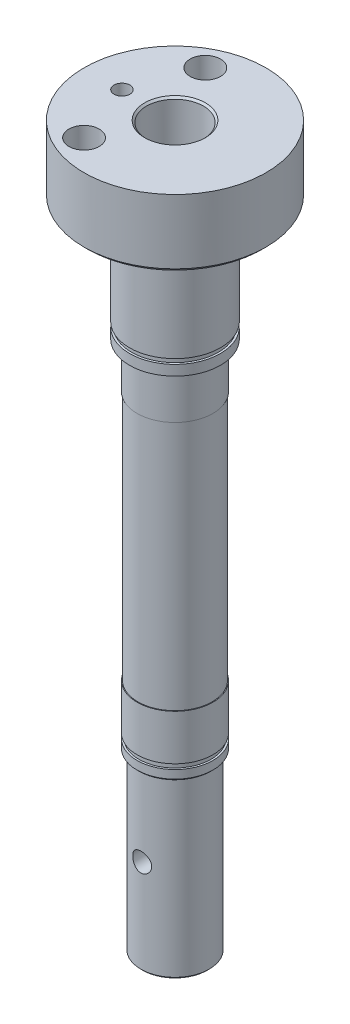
ISO-10303-21;
HEADER;
FILE_DESCRIPTION(('STEP AP214'),'2;1');
FILE_NAME('part.step','',(''),(''),'','','');
FILE_SCHEMA(('AUTOMOTIVE_DESIGN { 1 0 10303 214 1 1 1 1 }'));
ENDSEC;
DATA;
#1=APPLICATION_CONTEXT('core data for automotive mechanical design processes');
#2=APPLICATION_PROTOCOL_DEFINITION('international standard','automotive_design',2000,#1);
#3=PRODUCT_CONTEXT('',#1,'mechanical');
#4=PRODUCT('Part','Part','',(#3));
#5=PRODUCT_RELATED_PRODUCT_CATEGORY('part','',(#4));
#6=PRODUCT_DEFINITION_FORMATION('','',#4);
#7=PRODUCT_DEFINITION_CONTEXT('part definition',#1,'design');
#8=PRODUCT_DEFINITION('design','',#6,#7);
#9=PRODUCT_DEFINITION_SHAPE('','',#8);
#10=(LENGTH_UNIT() NAMED_UNIT(*) SI_UNIT(.MILLI.,.METRE.));
#11=(NAMED_UNIT(*) PLANE_ANGLE_UNIT() SI_UNIT($,.RADIAN.));
#12=(NAMED_UNIT(*) SI_UNIT($,.STERADIAN.) SOLID_ANGLE_UNIT());
#13=UNCERTAINTY_MEASURE_WITH_UNIT(LENGTH_MEASURE(1.E-05),#10,'distance_accuracy_value','');
#14=(GEOMETRIC_REPRESENTATION_CONTEXT(3) GLOBAL_UNCERTAINTY_ASSIGNED_CONTEXT((#13)) GLOBAL_UNIT_ASSIGNED_CONTEXT((#10,
#11,#12)) REPRESENTATION_CONTEXT('',''));
#15=CARTESIAN_POINT('',(0.,0.,0.));
#16=DIRECTION('',(0.,0.,1.));
#17=DIRECTION('',(1.,0.,0.));
#18=AXIS2_PLACEMENT_3D('',#15,#16,#17);
#19=CARTESIAN_POINT('',(0.,0.,0.));
#20=DIRECTION('',(0.,-1.,0.));
#21=DIRECTION('',(0.,0.,-1.));
#22=AXIS2_PLACEMENT_3D('',#19,#20,#21);
#23=CYLINDRICAL_SURFACE('',#22,9.99999999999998);
#24=CARTESIAN_POINT('',(0.,50.,0.));
#25=DIRECTION('',(0.,-1.,0.));
#26=DIRECTION('',(0.,0.,-1.));
#27=AXIS2_PLACEMENT_3D('',#24,#25,#26);
#28=CIRCLE('',#27,10.);
#29=CARTESIAN_POINT('',(0.,50.,-10.));
#30=VERTEX_POINT('',#29);
#31=EDGE_CURVE('E131',#30,#30,#28,.T.);
#32=ORIENTED_EDGE('',*,*,#31,.F.);
#33=EDGE_LOOP('',(#32));
#34=FACE_BOUND('',#33,.T.);
#35=CARTESIAN_POINT('',(0.,62.,0.));
#36=DIRECTION('',(0.,-1.,0.));
#37=DIRECTION('',(0.,0.,-1.));
#38=AXIS2_PLACEMENT_3D('',#35,#36,#37);
#39=CIRCLE('',#38,9.99999999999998);
#40=CARTESIAN_POINT('',(0.,62.,-9.99999999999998));
#41=VERTEX_POINT('',#40);
#42=EDGE_CURVE('E149',#41,#41,#39,.T.);
#43=ORIENTED_EDGE('',*,*,#42,.T.);
#44=EDGE_LOOP('',(#43));
#45=FACE_BOUND('',#44,.T.);
#46=ADVANCED_FACE('F38',(#34,#45),#23,.T.);
#47=CARTESIAN_POINT('',(0.,0.,0.));
#48=DIRECTION('',(0.,-1.,0.));
#49=DIRECTION('',(0.,0.,-1.));
#50=AXIS2_PLACEMENT_3D('',#47,#48,#49);
#51=CYLINDRICAL_SURFACE('',#50,12.);
#52=CARTESIAN_POINT('',(0.,140.,0.));
#53=DIRECTION('',(0.,-1.,0.));
#54=DIRECTION('',(0.,0.,-1.));
#55=AXIS2_PLACEMENT_3D('',#52,#53,#54);
#56=CIRCLE('',#55,12.);
#57=CARTESIAN_POINT('',(-11.9853571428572,140.,-0.592633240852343));
#58=VERTEX_POINT('',#57);
#59=CARTESIAN_POINT('',(-11.9853571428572,140.,0.592633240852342));
#60=VERTEX_POINT('',#59);
#61=EDGE_CURVE('E164',#58,#60,#56,.T.);
#62=ORIENTED_EDGE('',*,*,#61,.F.);
#63=DIRECTION('',(0.,1.,0.));
#64=VECTOR('',#63,1.);
#65=CARTESIAN_POINT('',(-11.9853571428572,141.35,-0.592633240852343));
#66=LINE('',#65,#64);
#67=CARTESIAN_POINT('',(-11.9853571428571,142.7,-0.592633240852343));
#68=VERTEX_POINT('',#67);
#69=EDGE_CURVE('E102',#58,#68,#66,.T.);
#70=ORIENTED_EDGE('',*,*,#69,.T.);
#71=CARTESIAN_POINT('',(0.,142.7,0.));
#72=DIRECTION('',(0.,-1.,0.));
#73=DIRECTION('',(0.,0.,-1.));
#74=AXIS2_PLACEMENT_3D('',#71,#72,#73);
#75=CIRCLE('',#74,12.);
#76=CARTESIAN_POINT('',(-11.9853571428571,142.7,0.592633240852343));
#77=VERTEX_POINT('',#76);
#78=EDGE_CURVE('E143',#68,#77,#75,.T.);
#79=ORIENTED_EDGE('',*,*,#78,.T.);
#80=DIRECTION('',(0.,1.,0.));
#81=VECTOR('',#80,1.);
#82=CARTESIAN_POINT('',(-11.9853571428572,141.35,0.592633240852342));
#83=LINE('',#82,#81);
#84=EDGE_CURVE('E53',#77,#60,#83,.F.);
#85=ORIENTED_EDGE('',*,*,#84,.T.);
#86=EDGE_LOOP('',(#62,#70,#79,#85));
#87=FACE_BOUND('',#86,.T.);
#88=ADVANCED_FACE('F238',(#87),#51,.T.);
#89=CARTESIAN_POINT('',(12.,140.,0.));
#90=DIRECTION('',(0.,1.,0.));
#91=DIRECTION('',(0.,0.,1.));
#92=AXIS2_PLACEMENT_3D('',#89,#90,#91);
#93=PLANE('',#92);
#94=CARTESIAN_POINT('',(0.,140.,0.));
#95=DIRECTION('',(0.,-1.,0.));
#96=DIRECTION('',(0.,0.,-1.));
#97=AXIS2_PLACEMENT_3D('',#94,#95,#96);
#98=CIRCLE('',#97,9.99999999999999);
#99=CARTESIAN_POINT('',(0.,140.,-9.99999999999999));
#100=VERTEX_POINT('',#99);
#101=EDGE_CURVE('E161',#100,#100,#98,.T.);
#102=ORIENTED_EDGE('',*,*,#101,.F.);
#103=EDGE_LOOP('',(#102));
#104=FACE_BOUND('',#103,.T.);
#105=ORIENTED_EDGE('',*,*,#61,.T.);
#106=CARTESIAN_POINT('',(-14.,140.,0.));
#107=DIRECTION('',(0.,1.,0.));
#108=DIRECTION('',(0.,0.,1.));
#109=AXIS2_PLACEMENT_3D('',#106,#107,#108);
#110=CIRCLE('',#109,2.09999999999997);
#111=EDGE_CURVE('E105',#60,#58,#110,.T.);
#112=ORIENTED_EDGE('',*,*,#111,.T.);
#113=EDGE_LOOP('',(#105,#112));
#114=FACE_BOUND('',#113,.T.);
#115=ADVANCED_FACE('F244',(#104,#114),#93,.F.);
#116=CARTESIAN_POINT('',(0.,0.,0.));
#117=DIRECTION('',(0.,-1.,0.));
#118=DIRECTION('',(0.,0.,-1.));
#119=AXIS2_PLACEMENT_3D('',#116,#117,#118);
#120=CYLINDRICAL_SURFACE('',#119,9.99999999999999);
#121=CARTESIAN_POINT('',(0.,128.,0.));
#122=DIRECTION('',(0.,-1.,0.));
#123=DIRECTION('',(0.,0.,-1.));
#124=AXIS2_PLACEMENT_3D('',#121,#122,#123);
#125=CIRCLE('',#124,9.99999999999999);
#126=CARTESIAN_POINT('',(0.,128.,-9.99999999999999));
#127=VERTEX_POINT('',#126);
#128=EDGE_CURVE('E158',#127,#127,#125,.T.);
#129=ORIENTED_EDGE('',*,*,#128,.F.);
#130=EDGE_LOOP('',(#129));
#131=FACE_BOUND('',#130,.T.);
#132=ORIENTED_EDGE('',*,*,#101,.T.);
#133=EDGE_LOOP('',(#132));
#134=FACE_BOUND('',#133,.T.);
#135=ADVANCED_FACE('F509',(#131,#134),#120,.T.);
#136=CARTESIAN_POINT('',(9.99999999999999,128.,0.));
#137=DIRECTION('',(0.,1.,0.));
#138=DIRECTION('',(0.,0.,1.));
#139=AXIS2_PLACEMENT_3D('',#136,#137,#138);
#140=PLANE('',#139);
#141=CARTESIAN_POINT('',(0.,128.,0.));
#142=DIRECTION('',(0.,-1.,0.));
#143=DIRECTION('',(0.,0.,-1.));
#144=AXIS2_PLACEMENT_3D('',#141,#142,#143);
#145=CIRCLE('',#144,9.79999999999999);
#146=CARTESIAN_POINT('',(0.,128.,-9.79999999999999));
#147=VERTEX_POINT('',#146);
#148=EDGE_CURVE('E155',#147,#147,#145,.T.);
#149=ORIENTED_EDGE('',*,*,#148,.F.);
#150=EDGE_LOOP('',(#149));
#151=FACE_BOUND('',#150,.T.);
#152=ORIENTED_EDGE('',*,*,#128,.T.);
#153=EDGE_LOOP('',(#152));
#154=FACE_BOUND('',#153,.T.);
#155=ADVANCED_FACE('F499',(#151,#154),#140,.F.);
#156=CARTESIAN_POINT('',(0.,0.,0.));
#157=DIRECTION('',(0.,-1.,0.));
#158=DIRECTION('',(0.,0.,-1.));
#159=AXIS2_PLACEMENT_3D('',#156,#157,#158);
#160=CYLINDRICAL_SURFACE('',#159,9.79999999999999);
#161=CARTESIAN_POINT('',(0.,62.,0.));
#162=DIRECTION('',(0.,-1.,0.));
#163=DIRECTION('',(0.,0.,-1.));
#164=AXIS2_PLACEMENT_3D('',#161,#162,#163);
#165=CIRCLE('',#164,9.79999999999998);
#166=CARTESIAN_POINT('',(0.,62.,-9.79999999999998));
#167=VERTEX_POINT('',#166);
#168=EDGE_CURVE('E152',#167,#167,#165,.T.);
#169=ORIENTED_EDGE('',*,*,#168,.F.);
#170=EDGE_LOOP('',(#169));
#171=FACE_BOUND('',#170,.T.);
#172=ORIENTED_EDGE('',*,*,#148,.T.);
#173=EDGE_LOOP('',(#172));
#174=FACE_BOUND('',#173,.T.);
#175=ADVANCED_FACE('F491',(#171,#174),#160,.T.);
#176=CARTESIAN_POINT('',(9.79999999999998,62.,0.));
#177=DIRECTION('',(0.,-1.,0.));
#178=DIRECTION('',(0.,0.,-1.));
#179=AXIS2_PLACEMENT_3D('',#176,#177,#178);
#180=PLANE('',#179);
#181=ORIENTED_EDGE('',*,*,#42,.F.);
#182=EDGE_LOOP('',(#181));
#183=FACE_BOUND('',#182,.T.);
#184=ORIENTED_EDGE('',*,*,#168,.T.);
#185=EDGE_LOOP('',(#184));
#186=FACE_BOUND('',#185,.T.);
#187=ADVANCED_FACE('F227',(#183,#186),#180,.F.);
#188=CARTESIAN_POINT('',(12.,142.7,0.));
#189=DIRECTION('',(0.,1.,0.));
#190=DIRECTION('',(0.,0.,1.));
#191=AXIS2_PLACEMENT_3D('',#188,#189,#190);
#192=PLANE('',#191);
#193=CARTESIAN_POINT('',(-14.,142.7,0.));
#194=DIRECTION('',(0.,1.,0.));
#195=DIRECTION('',(0.,0.,1.));
#196=AXIS2_PLACEMENT_3D('',#193,#194,#195);
#197=CIRCLE('',#196,2.09999999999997);
#198=EDGE_CURVE('E99',#77,#68,#197,.T.);
#199=ORIENTED_EDGE('',*,*,#198,.F.);
#200=ORIENTED_EDGE('',*,*,#78,.F.);
#201=EDGE_LOOP('',(#199,#200));
#202=FACE_BOUND('',#201,.T.);
#203=CARTESIAN_POINT('',(0.,142.7,0.));
#204=DIRECTION('',(0.,-1.,0.));
#205=DIRECTION('',(0.,0.,-1.));
#206=AXIS2_PLACEMENT_3D('',#203,#204,#205);
#207=CIRCLE('',#206,11.45);
#208=CARTESIAN_POINT('',(0.,142.7,-11.45));
#209=VERTEX_POINT('',#208);
#210=EDGE_CURVE('E140',#209,#209,#207,.T.);
#211=ORIENTED_EDGE('',*,*,#210,.T.);
#212=EDGE_LOOP('',(#211));
#213=FACE_BOUND('',#212,.T.);
#214=ADVANCED_FACE('F224',(#202,#213),#192,.T.);
#215=CARTESIAN_POINT('',(0.,0.,0.));
#216=DIRECTION('',(0.,-1.,0.));
#217=DIRECTION('',(0.,0.,-1.));
#218=AXIS2_PLACEMENT_3D('',#215,#216,#217);
#219=CYLINDRICAL_SURFACE('',#218,11.45);
#220=ORIENTED_EDGE('',*,*,#210,.F.);
#221=EDGE_LOOP('',(#220));
#222=FACE_BOUND('',#221,.T.);
#223=CARTESIAN_POINT('',(0.,144.,0.));
#224=DIRECTION('',(0.,-1.,0.));
#225=DIRECTION('',(0.,0.,-1.));
#226=AXIS2_PLACEMENT_3D('',#223,#224,#225);
#227=CIRCLE('',#226,11.45);
#228=CARTESIAN_POINT('',(0.,144.,-11.45));
#229=VERTEX_POINT('',#228);
#230=EDGE_CURVE('E137',#229,#229,#227,.T.);
#231=ORIENTED_EDGE('',*,*,#230,.T.);
#232=EDGE_LOOP('',(#231));
#233=FACE_BOUND('',#232,.T.);
#234=ADVANCED_FACE('F220',(#222,#233),#219,.T.);
#235=CARTESIAN_POINT('',(11.45,144.,0.));
#236=DIRECTION('',(0.,-1.,0.));
#237=DIRECTION('',(0.,0.,-1.));
#238=AXIS2_PLACEMENT_3D('',#235,#236,#237);
#239=PLANE('',#238);
#240=CARTESIAN_POINT('',(-14.,144.,0.));
#241=DIRECTION('',(0.,-1.,0.));
#242=DIRECTION('',(0.,0.,-1.));
#243=AXIS2_PLACEMENT_3D('',#240,#241,#242);
#244=CIRCLE('',#243,2.09999999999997);
#245=CARTESIAN_POINT('',(-11.9853571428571,144.,-0.592633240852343));
#246=VERTEX_POINT('',#245);
#247=CARTESIAN_POINT('',(-11.9853571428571,144.,0.592633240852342));
#248=VERTEX_POINT('',#247);
#249=EDGE_CURVE('E61',#246,#248,#244,.T.);
#250=ORIENTED_EDGE('',*,*,#249,.F.);
#251=CARTESIAN_POINT('',(0.,144.,0.));
#252=DIRECTION('',(0.,-1.,0.));
#253=DIRECTION('',(0.,0.,-1.));
#254=AXIS2_PLACEMENT_3D('',#251,#252,#253);
#255=CIRCLE('',#254,12.);
#256=EDGE_CURVE('E134',#246,#248,#255,.T.);
#257=ORIENTED_EDGE('',*,*,#256,.T.);
#258=EDGE_LOOP('',(#250,#257));
#259=FACE_BOUND('',#258,.T.);
#260=ORIENTED_EDGE('',*,*,#230,.F.);
#261=EDGE_LOOP('',(#260));
#262=FACE_BOUND('',#261,.T.);
#263=ADVANCED_FACE('F217',(#259,#262),#239,.T.);
#264=CARTESIAN_POINT('',(0.,190.,0.));
#265=DIRECTION('',(0.,-1.,0.));
#266=DIRECTION('',(0.,0.,-1.));
#267=AXIS2_PLACEMENT_3D('',#264,#265,#266);
#268=PLANE('',#267);
#269=CARTESIAN_POINT('',(0.,190.,0.));
#270=DIRECTION('',(0.,-1.,0.));
#271=DIRECTION('',(0.,0.,-1.));
#272=AXIS2_PLACEMENT_3D('',#269,#270,#271);
#273=CIRCLE('',#272,8.);
#274=CARTESIAN_POINT('',(0.,190.,-8.));
#275=VERTEX_POINT('',#274);
#276=EDGE_CURVE('E11',#275,#275,#273,.T.);
#277=ORIENTED_EDGE('',*,*,#276,.T.);
#278=EDGE_LOOP('',(#277));
#279=FACE_BOUND('',#278,.T.);
#280=CARTESIAN_POINT('',(-14.,190.,0.));
#281=DIRECTION('',(0.,1.,0.));
#282=DIRECTION('',(0.,0.,1.));
#283=AXIS2_PLACEMENT_3D('',#280,#281,#282);
#284=CIRCLE('',#283,2.09999999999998);
#285=CARTESIAN_POINT('',(-14.,190.,2.09999999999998));
#286=VERTEX_POINT('',#285);
#287=EDGE_CURVE('E90',#286,#286,#284,.T.);
#288=ORIENTED_EDGE('',*,*,#287,.F.);
#289=EDGE_LOOP('',(#288));
#290=FACE_BOUND('',#289,.T.);
#291=CARTESIAN_POINT('',(-8.,190.,16.));
#292=DIRECTION('',(0.,1.,0.));
#293=DIRECTION('',(0.,0.,1.));
#294=AXIS2_PLACEMENT_3D('',#291,#292,#293);
#295=CIRCLE('',#294,4.);
#296=CARTESIAN_POINT('',(-8.,190.,20.));
#297=VERTEX_POINT('',#296);
#298=EDGE_CURVE('E108',#297,#297,#295,.T.);
#299=ORIENTED_EDGE('',*,*,#298,.F.);
#300=EDGE_LOOP('',(#299));
#301=FACE_BOUND('',#300,.T.);
#302=CARTESIAN_POINT('',(-8.,190.,-16.));
#303=DIRECTION('',(0.,1.,0.));
#304=DIRECTION('',(0.,0.,1.));
#305=AXIS2_PLACEMENT_3D('',#302,#303,#304);
#306=CIRCLE('',#305,4.);
#307=CARTESIAN_POINT('',(-8.,190.,-12.));
#308=VERTEX_POINT('',#307);
#309=EDGE_CURVE('E115',#308,#308,#306,.T.);
#310=ORIENTED_EDGE('',*,*,#309,.F.);
#311=EDGE_LOOP('',(#310));
#312=FACE_BOUND('',#311,.T.);
#313=CARTESIAN_POINT('',(0.,190.,0.));
#314=DIRECTION('',(0.,-1.,0.));
#315=DIRECTION('',(0.,0.,-1.));
#316=AXIS2_PLACEMENT_3D('',#313,#314,#315);
#317=CIRCLE('',#316,24.);
#318=CARTESIAN_POINT('',(0.,190.,-24.));
#319=VERTEX_POINT('',#318);
#320=EDGE_CURVE('E170',#319,#319,#317,.T.);
#321=ORIENTED_EDGE('',*,*,#320,.F.);
#322=EDGE_LOOP('',(#321));
#323=FACE_BOUND('',#322,.T.);
#324=ADVANCED_FACE('F40',(#279,#290,#301,#312,#323),#268,.F.);
#325=CARTESIAN_POINT('',(0.,0.,0.));
#326=DIRECTION('',(0.,-1.,0.));
#327=DIRECTION('',(0.,0.,-1.));
#328=AXIS2_PLACEMENT_3D('',#325,#326,#327);
#329=CYLINDRICAL_SURFACE('',#328,24.);
#330=CARTESIAN_POINT('',(0.,173.,0.));
#331=DIRECTION('',(0.,1.,0.));
#332=DIRECTION('',(0.,0.,1.));
#333=AXIS2_PLACEMENT_3D('',#330,#331,#332);
#334=CIRCLE('',#333,24.);
#335=CARTESIAN_POINT('',(0.,173.,24.));
#336=VERTEX_POINT('',#335);
#337=EDGE_CURVE('E269',#336,#336,#334,.T.);
#338=ORIENTED_EDGE('',*,*,#337,.T.);
#339=EDGE_LOOP('',(#338));
#340=FACE_BOUND('',#339,.T.);
#341=ORIENTED_EDGE('',*,*,#320,.T.);
#342=EDGE_LOOP('',(#341));
#343=FACE_BOUND('',#342,.T.);
#344=ADVANCED_FACE('F384',(#340,#343),#329,.T.);
#345=CARTESIAN_POINT('',(24.,172.,0.));
#346=DIRECTION('',(0.,1.,0.));
#347=DIRECTION('',(0.,0.,1.));
#348=AXIS2_PLACEMENT_3D('',#345,#346,#347);
#349=PLANE('',#348);
#350=CARTESIAN_POINT('',(-8.,172.,16.));
#351=DIRECTION('',(0.,1.,0.));
#352=DIRECTION('',(0.,0.,1.));
#353=AXIS2_PLACEMENT_3D('',#350,#351,#352);
#354=CIRCLE('',#353,4.);
#355=CARTESIAN_POINT('',(-8.,172.,20.));
#356=VERTEX_POINT('',#355);
#357=EDGE_CURVE('E111',#356,#356,#354,.F.);
#358=ORIENTED_EDGE('',*,*,#357,.F.);
#359=EDGE_LOOP('',(#358));
#360=FACE_BOUND('',#359,.T.);
#361=CARTESIAN_POINT('',(0.,172.,0.));
#362=DIRECTION('',(0.,1.,0.));
#363=DIRECTION('',(0.,0.,1.));
#364=AXIS2_PLACEMENT_3D('',#361,#362,#363);
#365=CIRCLE('',#364,23.);
#366=CARTESIAN_POINT('',(0.,172.,23.));
#367=VERTEX_POINT('',#366);
#368=EDGE_CURVE('E265',#367,#367,#365,.F.);
#369=ORIENTED_EDGE('',*,*,#368,.T.);
#370=EDGE_LOOP('',(#369));
#371=FACE_BOUND('',#370,.T.);
#372=CARTESIAN_POINT('',(-8.,172.,-16.));
#373=DIRECTION('',(0.,1.,0.));
#374=DIRECTION('',(0.,0.,1.));
#375=AXIS2_PLACEMENT_3D('',#372,#373,#374);
#376=CIRCLE('',#375,4.);
#377=CARTESIAN_POINT('',(-8.,172.,-12.));
#378=VERTEX_POINT('',#377);
#379=EDGE_CURVE('E118',#378,#378,#376,.F.);
#380=ORIENTED_EDGE('',*,*,#379,.F.);
#381=EDGE_LOOP('',(#380));
#382=FACE_BOUND('',#381,.T.);
#383=CARTESIAN_POINT('',(0.,172.,0.));
#384=DIRECTION('',(0.,-1.,0.));
#385=DIRECTION('',(0.,0.,-1.));
#386=AXIS2_PLACEMENT_3D('',#383,#384,#385);
#387=CIRCLE('',#386,12.);
#388=CARTESIAN_POINT('',(-11.9853571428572,172.,-0.592633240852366));
#389=VERTEX_POINT('',#388);
#390=CARTESIAN_POINT('',(-11.9853571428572,172.,0.592633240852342));
#391=VERTEX_POINT('',#390);
#392=EDGE_CURVE('E167',#389,#391,#387,.T.);
#393=ORIENTED_EDGE('',*,*,#392,.F.);
#394=CARTESIAN_POINT('',(-14.,172.,0.));
#395=DIRECTION('',(0.,1.,0.));
#396=DIRECTION('',(0.,0.,1.));
#397=AXIS2_PLACEMENT_3D('',#394,#395,#396);
#398=CIRCLE('',#397,2.09999999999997);
#399=EDGE_CURVE('E93',#389,#391,#398,.T.);
#400=ORIENTED_EDGE('',*,*,#399,.T.);
#401=EDGE_LOOP('',(#393,#400));
#402=FACE_BOUND('',#401,.T.);
#403=ADVANCED_FACE('F466',(#360,#371,#382,#402),#349,.F.);
#404=ORIENTED_EDGE('',*,*,#256,.F.);
#405=DIRECTION('',(0.,1.,0.));
#406=VECTOR('',#405,1.);
#407=CARTESIAN_POINT('',(-11.9853571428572,95.,-0.592633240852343));
#408=LINE('',#407,#406);
#409=EDGE_CURVE('E280',#246,#389,#408,.T.);
#410=ORIENTED_EDGE('',*,*,#409,.T.);
#411=ORIENTED_EDGE('',*,*,#392,.T.);
#412=DIRECTION('',(0.,1.,0.));
#413=VECTOR('',#412,1.);
#414=CARTESIAN_POINT('',(-11.9853571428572,95.,0.592633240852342));
#415=LINE('',#414,#413);
#416=EDGE_CURVE('E278',#391,#248,#415,.F.);
#417=ORIENTED_EDGE('',*,*,#416,.T.);
#418=EDGE_LOOP('',(#404,#410,#411,#417));
#419=FACE_BOUND('',#418,.T.);
#420=ADVANCED_FACE('F215',(#419),#51,.T.);
#421=CARTESIAN_POINT('',(10.,50.,0.));
#422=DIRECTION('',(0.,1.,0.));
#423=DIRECTION('',(0.,0.,1.));
#424=AXIS2_PLACEMENT_3D('',#421,#422,#423);
#425=PLANE('',#424);
#426=CARTESIAN_POINT('',(0.,50.,0.));
#427=DIRECTION('',(0.,-1.,0.));
#428=DIRECTION('',(0.,0.,-1.));
#429=AXIS2_PLACEMENT_3D('',#426,#427,#428);
#430=CIRCLE('',#429,9.5);
#431=CARTESIAN_POINT('',(0.,50.,-9.5));
#432=VERTEX_POINT('',#431);
#433=EDGE_CURVE('E128',#432,#432,#430,.T.);
#434=ORIENTED_EDGE('',*,*,#433,.F.);
#435=EDGE_LOOP('',(#434));
#436=FACE_BOUND('',#435,.T.);
#437=ORIENTED_EDGE('',*,*,#31,.T.);
#438=EDGE_LOOP('',(#437));
#439=FACE_BOUND('',#438,.T.);
#440=ADVANCED_FACE('F211',(#436,#439),#425,.F.);
#441=CARTESIAN_POINT('',(0.,0.,0.));
#442=DIRECTION('',(0.,-1.,0.));
#443=DIRECTION('',(0.,0.,-1.));
#444=AXIS2_PLACEMENT_3D('',#441,#442,#443);
#445=CYLINDRICAL_SURFACE('',#444,9.5);
#446=ORIENTED_EDGE('',*,*,#433,.T.);
#447=EDGE_LOOP('',(#446));
#448=FACE_BOUND('',#447,.T.);
#449=CARTESIAN_POINT('',(0.,48.7,0.));
#450=DIRECTION('',(0.,-1.,0.));
#451=DIRECTION('',(0.,0.,-1.));
#452=AXIS2_PLACEMENT_3D('',#449,#450,#451);
#453=CIRCLE('',#452,9.5);
#454=CARTESIAN_POINT('',(0.,48.7,-9.5));
#455=VERTEX_POINT('',#454);
#456=EDGE_CURVE('E125',#455,#455,#453,.T.);
#457=ORIENTED_EDGE('',*,*,#456,.F.);
#458=EDGE_LOOP('',(#457));
#459=FACE_BOUND('',#458,.T.);
#460=ADVANCED_FACE('F207',(#448,#459),#445,.T.);
#461=CARTESIAN_POINT('',(9.5,48.7,0.));
#462=DIRECTION('',(0.,-1.,0.));
#463=DIRECTION('',(0.,0.,-1.));
#464=AXIS2_PLACEMENT_3D('',#461,#462,#463);
#465=PLANE('',#464);
#466=CARTESIAN_POINT('',(0.,48.7,0.));
#467=DIRECTION('',(0.,-1.,0.));
#468=DIRECTION('',(0.,0.,-1.));
#469=AXIS2_PLACEMENT_3D('',#466,#467,#468);
#470=CIRCLE('',#469,10.);
#471=CARTESIAN_POINT('',(0.,48.7,-10.));
#472=VERTEX_POINT('',#471);
#473=EDGE_CURVE('E122',#472,#472,#470,.T.);
#474=ORIENTED_EDGE('',*,*,#473,.F.);
#475=EDGE_LOOP('',(#474));
#476=FACE_BOUND('',#475,.T.);
#477=ORIENTED_EDGE('',*,*,#456,.T.);
#478=EDGE_LOOP('',(#477));
#479=FACE_BOUND('',#478,.T.);
#480=ADVANCED_FACE('F203',(#476,#479),#465,.F.);
#481=CARTESIAN_POINT('',(8.99999999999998,0.,0.));
#482=DIRECTION('',(0.,1.,0.));
#483=DIRECTION('',(0.,0.,1.));
#484=AXIS2_PLACEMENT_3D('',#481,#482,#483);
#485=PLANE('',#484);
#486=CARTESIAN_POINT('',(0.,0.,0.));
#487=DIRECTION('',(0.,1.,0.));
#488=DIRECTION('',(0.,0.,1.));
#489=AXIS2_PLACEMENT_3D('',#486,#487,#488);
#490=CIRCLE('',#489,8.49999999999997);
#491=CARTESIAN_POINT('',(0.,0.,8.49999999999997));
#492=VERTEX_POINT('',#491);
#493=EDGE_CURVE('E173',#492,#492,#490,.F.);
#494=ORIENTED_EDGE('',*,*,#493,.T.);
#495=EDGE_LOOP('',(#494));
#496=FACE_BOUND('',#495,.T.);
#497=ADVANCED_FACE('F206',(#496),#485,.F.);
#498=CARTESIAN_POINT('',(0.,0.,0.));
#499=DIRECTION('',(0.,-1.,0.));
#500=DIRECTION('',(0.,0.,-1.));
#501=AXIS2_PLACEMENT_3D('',#498,#499,#500);
#502=CYLINDRICAL_SURFACE('',#501,8.99999999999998);
#503=CARTESIAN_POINT('',(0.,0.500000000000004,0.));
#504=DIRECTION('',(0.,1.,0.));
#505=DIRECTION('',(0.,0.,1.));
#506=AXIS2_PLACEMENT_3D('',#503,#504,#505);
#507=CIRCLE('',#506,8.99999999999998);
#508=CARTESIAN_POINT('',(0.,0.500000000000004,8.99999999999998));
#509=VERTEX_POINT('',#508);
#510=EDGE_CURVE('E272',#509,#509,#507,.T.);
#511=ORIENTED_EDGE('',*,*,#510,.T.);
#512=EDGE_LOOP('',(#511));
#513=FACE_BOUND('',#512,.T.);
#514=CARTESIAN_POINT('',(0.,27.5,-8.99999999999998));
#515=CARTESIAN_POINT('',(-0.137602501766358,27.4999972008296,-8.99999816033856));
#516=CARTESIAN_POINT('',(-0.275234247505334,27.4886013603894,-8.99681348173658));
#517=CARTESIAN_POINT('',(-0.546518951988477,27.4434085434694,-8.98441900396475));
#518=CARTESIAN_POINT('',(-0.680170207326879,27.4096021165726,-8.97520666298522));
#519=CARTESIAN_POINT('',(-0.939539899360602,27.3207825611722,-8.95177130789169));
#520=CARTESIAN_POINT('',(-1.06526878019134,27.2657980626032,-8.93755506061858));
#521=CARTESIAN_POINT('',(-1.30572139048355,27.1362929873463,-8.90560625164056));
#522=CARTESIAN_POINT('',(-1.4204441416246,27.0617706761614,-8.88787337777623));
#523=CARTESIAN_POINT('',(-1.63849356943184,26.8933411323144,-8.85030315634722));
#524=CARTESIAN_POINT('',(-1.7415062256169,26.7990359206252,-8.83042747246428));
#525=CARTESIAN_POINT('',(-1.93047637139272,26.5945674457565,-8.7910521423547));
#526=CARTESIAN_POINT('',(-2.01643146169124,26.4844019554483,-8.77155254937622));
#527=CARTESIAN_POINT('',(-2.17041617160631,26.2487854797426,-8.73474088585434));
#528=CARTESIAN_POINT('',(-2.23807749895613,26.1230855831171,-8.71747695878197));
#529=CARTESIAN_POINT('',(-2.35117914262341,25.8615361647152,-8.68765801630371));
#530=CARTESIAN_POINT('',(-2.39662394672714,25.7256886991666,-8.67510204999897));
#531=CARTESIAN_POINT('',(-2.46289848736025,25.4511944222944,-8.65651766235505));
#532=CARTESIAN_POINT('',(-2.48430073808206,25.3126963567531,-8.65033771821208));
#533=CARTESIAN_POINT('',(-2.50366854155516,25.0339482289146,-8.64475298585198));
#534=CARTESIAN_POINT('',(-2.50163888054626,24.8936985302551,-8.64534681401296));
#535=CARTESIAN_POINT('',(-2.4746534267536,24.6199554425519,-8.6531073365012));
#536=CARTESIAN_POINT('',(-2.45039804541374,24.4863863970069,-8.66007321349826));
#537=CARTESIAN_POINT('',(-2.38077462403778,24.2252927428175,-8.67947034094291));
#538=CARTESIAN_POINT('',(-2.33540476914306,24.0977686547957,-8.69190206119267));
#539=CARTESIAN_POINT('',(-2.22428746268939,23.8505955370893,-8.72100139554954));
#540=CARTESIAN_POINT('',(-2.15830043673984,23.7310602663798,-8.73771837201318));
#541=CARTESIAN_POINT('',(-2.00798881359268,23.5045168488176,-8.77347901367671));
#542=CARTESIAN_POINT('',(-1.9236603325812,23.3975113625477,-8.79252317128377));
#543=CARTESIAN_POINT('',(-1.73551122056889,23.1950722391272,-8.83162144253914));
#544=CARTESIAN_POINT('',(-1.63110455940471,23.1001847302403,-8.8516874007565));
#545=CARTESIAN_POINT('',(-1.40761321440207,22.9291485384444,-8.88996399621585));
#546=CARTESIAN_POINT('',(-1.28852785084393,22.8530007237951,-8.90817454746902));
#547=CARTESIAN_POINT('',(-1.03816685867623,22.7213363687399,-8.94081679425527));
#548=CARTESIAN_POINT('',(-0.906832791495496,22.6659257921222,-8.95522897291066));
#549=CARTESIAN_POINT('',(-0.636219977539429,22.5781318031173,-8.97850985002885));
#550=CARTESIAN_POINT('',(-0.496943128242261,22.5457429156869,-8.98737986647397));
#551=CARTESIAN_POINT('',(-0.219053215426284,22.5057857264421,-8.99837472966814));
#552=CARTESIAN_POINT('',(-0.0805546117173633,22.4974757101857,-9.00070107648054));
#553=CARTESIAN_POINT('',(0.195859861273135,22.5038539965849,-8.9989296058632));
#554=CARTESIAN_POINT('',(0.33377579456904,22.5185397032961,-8.99483251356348));
#555=CARTESIAN_POINT('',(0.602413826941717,22.5698866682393,-8.9808053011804));
#556=CARTESIAN_POINT('',(0.73322257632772,22.606127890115,-8.97098674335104));
#557=CARTESIAN_POINT('',(0.986886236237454,22.6990637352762,-8.9466365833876));
#558=CARTESIAN_POINT('',(1.10974024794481,22.7557606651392,-8.93210444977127));
#559=CARTESIAN_POINT('',(1.34684028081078,22.8893317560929,-8.8994748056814));
#560=CARTESIAN_POINT('',(1.4608541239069,22.9666010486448,-8.88130942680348));
#561=CARTESIAN_POINT('',(1.67455534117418,23.1386322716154,-8.84350954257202));
#562=CARTESIAN_POINT('',(1.77423962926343,23.2333979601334,-8.82387472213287));
#563=CARTESIAN_POINT('',(1.9596240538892,23.4412028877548,-8.78459685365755));
#564=CARTESIAN_POINT('',(2.04479915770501,23.5547149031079,-8.76497216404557));
#565=CARTESIAN_POINT('',(2.1949116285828,23.7948412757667,-8.72859386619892));
#566=CARTESIAN_POINT('',(2.25984976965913,23.9214551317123,-8.71184014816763));
#567=CARTESIAN_POINT('',(2.36716211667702,24.1836143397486,-8.68329597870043));
#568=CARTESIAN_POINT('',(2.40966154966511,24.3191052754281,-8.67147806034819));
#569=CARTESIAN_POINT('',(2.47115304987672,24.5956994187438,-8.65415753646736));
#570=CARTESIAN_POINT('',(2.49015175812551,24.7368010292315,-8.64865314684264));
#571=CARTESIAN_POINT('',(2.50369719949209,25.0152115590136,-8.6447407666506));
#572=CARTESIAN_POINT('',(2.49909142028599,25.1524763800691,-8.64608680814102));
#573=CARTESIAN_POINT('',(2.4675428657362,25.4241897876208,-8.65514273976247));
#574=CARTESIAN_POINT('',(2.4406007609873,25.5586384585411,-8.66285243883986));
#575=CARTESIAN_POINT('',(2.36565448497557,25.8197344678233,-8.6836143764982));
#576=CARTESIAN_POINT('',(2.31784429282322,25.9464416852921,-8.69661733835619));
#577=CARTESIAN_POINT('',(2.20266903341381,26.1901348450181,-8.72649832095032));
#578=CARTESIAN_POINT('',(2.13530066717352,26.3071191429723,-8.74337699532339));
#579=CARTESIAN_POINT('',(1.98041392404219,26.5320553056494,-8.77977621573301));
#580=CARTESIAN_POINT('',(1.8923241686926,26.6396029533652,-8.79936357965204));
#581=CARTESIAN_POINT('',(1.69956305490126,26.8386647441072,-8.8386166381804));
#582=CARTESIAN_POINT('',(1.59488759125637,26.930174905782,-8.85828235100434));
#583=CARTESIAN_POINT('',(1.36892046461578,27.0967162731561,-8.89603679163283));
#584=CARTESIAN_POINT('',(1.24729251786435,27.1713032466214,-8.91407682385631));
#585=CARTESIAN_POINT('',(0.992723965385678,27.298856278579,-8.94599949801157));
#586=CARTESIAN_POINT('',(0.859790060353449,27.3518350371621,-8.95988458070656));
#587=CARTESIAN_POINT('',(0.606290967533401,27.4284401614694,-8.98032149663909));
#588=CARTESIAN_POINT('',(0.486728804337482,27.4552095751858,-8.98764491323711));
#589=CARTESIAN_POINT('',(0.244785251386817,27.4909896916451,-8.99748469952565));
#590=CARTESIAN_POINT('',(0.12240419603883,27.5000024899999,-9.00000163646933));
#591=CARTESIAN_POINT('',(0.,27.5,-8.99999999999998));
#592=B_SPLINE_CURVE_WITH_KNOTS('',3,(#514,#515,#516,#517,#518,#519,#520,#521,#522,#523,#524,
#525,#526,#527,#528,#529,#530,#531,#532,#533,#534,#535,#536,#537,#538,#539,#540,#541,#542,#543,
#544,#545,#546,#547,#548,#549,#550,#551,#552,#553,#554,#555,#556,#557,#558,#559,#560,#561,#562,
#563,#564,#565,#566,#567,#568,#569,#570,#571,#572,#573,#574,#575,#576,#577,#578,#579,#580,#581,
#582,#583,#584,#585,#586,#587,#588,#589,#590,#591),.UNSPECIFIED.,.T.,.F.,(4,2,2,2,2,2,2,2,2,2,2,
2,2,2,2,2,2,2,2,2,2,2,2,2,2,2,2,2,2,2,2,2,2,2,2,2,2,2,4),(0.,0.412358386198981,
0.824890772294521,1.23686741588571,1.64888064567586,2.07015248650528,2.49148354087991,
2.92075380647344,3.34993732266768,3.76866863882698,4.18731442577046,4.593204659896,
4.99912978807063,5.40995920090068,5.82087569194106,6.2463898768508,6.67192377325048,
7.09960331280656,7.5271811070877,7.94144021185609,8.35565255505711,8.76204634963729,
9.16848598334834,9.58337897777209,9.99836119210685,10.4261198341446,10.8538621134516,
11.279191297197,11.7044002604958,12.114451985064,12.5244913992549,12.9307978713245,
13.3371729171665,13.7564382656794,14.1758075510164,14.6051618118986,15.0342633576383,
15.4011197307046,15.7679328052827),.UNSPECIFIED.);
#593=CARTESIAN_POINT('',(0.,27.5,-8.99999999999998));
#594=VERTEX_POINT('',#593);
#595=EDGE_CURVE('E119',#594,#594,#592,.T.);
#596=ORIENTED_EDGE('',*,*,#595,.T.);
#597=EDGE_LOOP('',(#596));
#598=FACE_BOUND('',#597,.T.);
#599=CARTESIAN_POINT('',(2.5,25.,8.64580823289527));
#600=CARTESIAN_POINT('',(2.49999714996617,24.8625130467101,8.64581037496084));
#601=CARTESIAN_POINT('',(2.48861977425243,24.7249967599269,8.64912360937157));
#602=CARTESIAN_POINT('',(2.44350693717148,24.4539514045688,8.66197474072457));
#603=CARTESIAN_POINT('',(2.40976148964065,24.3204241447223,8.67151541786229));
#604=CARTESIAN_POINT('',(2.32112008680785,24.0613176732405,8.69565935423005));
#605=CARTESIAN_POINT('',(2.26625559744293,23.9357269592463,8.71025507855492));
#606=CARTESIAN_POINT('',(2.13703377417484,23.6955090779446,8.74285475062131));
#607=CARTESIAN_POINT('',(2.06267446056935,23.5808830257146,8.76085904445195));
#608=CARTESIAN_POINT('',(1.89441531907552,23.3627381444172,8.79879482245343));
#609=CARTESIAN_POINT('',(1.80008077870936,23.2595608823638,8.81876275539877));
#610=CARTESIAN_POINT('',(1.59548286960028,23.0702691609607,8.85806239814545));
#611=CARTESIAN_POINT('',(1.48521773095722,22.984156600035,8.87739403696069));
#612=CARTESIAN_POINT('',(1.249500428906,22.8299955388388,8.91365202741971));
#613=CARTESIAN_POINT('',(1.12381632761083,22.7622894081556,8.93053038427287));
#614=CARTESIAN_POINT('',(0.862300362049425,22.6491007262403,8.95956018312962));
#615=CARTESIAN_POINT('',(0.726470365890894,22.603614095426,8.97171249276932));
#616=CARTESIAN_POINT('',(0.452086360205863,22.5372690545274,8.98966318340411));
#617=CARTESIAN_POINT('',(0.313682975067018,22.5158289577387,8.99561138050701));
#618=CARTESIAN_POINT('',(0.0351244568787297,22.496352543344,9.0010086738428));
#619=CARTESIAN_POINT('',(-0.105030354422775,22.4983119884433,9.00045894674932));
#620=CARTESIAN_POINT('',(-0.379054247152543,22.5251755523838,8.99303086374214));
#621=CARTESIAN_POINT('',(-0.512990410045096,22.5494507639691,8.98632598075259));
#622=CARTESIAN_POINT('',(-0.774807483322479,22.6192371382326,8.96754760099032));
#623=CARTESIAN_POINT('',(-0.902688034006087,22.6647495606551,8.95547378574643));
#624=CARTESIAN_POINT('',(-1.15033359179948,22.7761820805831,8.92706250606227));
#625=CARTESIAN_POINT('',(-1.26999902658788,22.8423119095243,8.91068150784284));
#626=CARTESIAN_POINT('',(-1.49674457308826,22.9929396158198,8.87541221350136));
#627=CARTESIAN_POINT('',(-1.60382204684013,23.077441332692,8.85652339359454));
#628=CARTESIAN_POINT('',(-1.80610676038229,23.2657286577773,8.81753663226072));
#629=CARTESIAN_POINT('',(-1.9008012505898,23.3700618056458,8.79741936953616));
#630=CARTESIAN_POINT('',(-2.07148108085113,23.5933326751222,8.75880383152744));
#631=CARTESIAN_POINT('',(-2.14746507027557,23.7122714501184,8.74030567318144));
#632=CARTESIAN_POINT('',(-2.27900238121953,23.9625647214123,8.70694013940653));
#633=CARTESIAN_POINT('',(-2.33440501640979,24.0940022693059,8.69209980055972));
#634=CARTESIAN_POINT('',(-2.42215297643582,24.3648435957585,8.66806022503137));
#635=CARTESIAN_POINT('',(-2.45450458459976,24.5042451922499,8.65885945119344));
#636=CARTESIAN_POINT('',(-2.49432455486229,24.7822345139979,8.64747148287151));
#637=CARTESIAN_POINT('',(-2.50256249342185,24.920703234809,8.64506746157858));
#638=CARTESIAN_POINT('',(-2.49605092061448,25.1970419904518,8.64694988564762));
#639=CARTESIAN_POINT('',(-2.48130409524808,25.3349120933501,8.65123554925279));
#640=CARTESIAN_POINT('',(-2.42992241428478,25.6030977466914,8.66580389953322));
#641=CARTESIAN_POINT('',(-2.39376059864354,25.7335116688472,8.67595686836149));
#642=CARTESIAN_POINT('',(-2.30111259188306,25.9864202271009,8.70098664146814));
#643=CARTESIAN_POINT('',(-2.24462358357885,26.1089137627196,8.71586410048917));
#644=CARTESIAN_POINT('',(-2.11139571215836,26.3456953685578,8.74910362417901));
#645=CARTESIAN_POINT('',(-2.03421067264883,26.4597217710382,8.76753959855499));
#646=CARTESIAN_POINT('',(-1.86232721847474,26.6734862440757,8.80564999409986));
#647=CARTESIAN_POINT('',(-1.76762522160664,26.7732213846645,8.82532466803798));
#648=CARTESIAN_POINT('',(-1.55981743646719,26.9588214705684,8.86445019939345));
#649=CARTESIAN_POINT('',(-1.44622359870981,27.0441468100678,8.88387421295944));
#650=CARTESIAN_POINT('',(-1.20588311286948,27.1945239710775,8.91967402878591));
#651=CARTESIAN_POINT('',(-1.07913716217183,27.2595768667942,8.93604999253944));
#652=CARTESIAN_POINT('',(-0.816978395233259,27.3669495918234,8.9638032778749));
#653=CARTESIAN_POINT('',(-0.681640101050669,27.4094411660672,8.9752182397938));
#654=CARTESIAN_POINT('',(-0.405376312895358,27.4709681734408,8.99192942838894));
#655=CARTESIAN_POINT('',(-0.264452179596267,27.4900092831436,8.99722713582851));
#656=CARTESIAN_POINT('',(0.0139601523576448,27.5037143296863,9.0010304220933));
#657=CARTESIAN_POINT('',(0.151407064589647,27.4991667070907,8.99975568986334));
#658=CARTESIAN_POINT('',(0.423500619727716,27.4676714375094,8.99106088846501));
#659=CARTESIAN_POINT('',(0.55814738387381,27.4407247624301,8.98364108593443));
#660=CARTESIAN_POINT('',(0.819784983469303,27.3656567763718,8.96353984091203));
#661=CARTESIAN_POINT('',(0.946828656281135,27.3177074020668,8.95090116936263));
#662=CARTESIAN_POINT('',(1.19113920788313,27.2021480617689,8.92167820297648));
#663=CARTESIAN_POINT('',(1.30840462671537,27.1345351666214,8.90509332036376));
#664=CARTESIAN_POINT('',(1.53345112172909,26.9793280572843,8.86915397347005));
#665=CARTESIAN_POINT('',(1.64086726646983,26.8912199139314,8.84973411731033));
#666=CARTESIAN_POINT('',(1.83965563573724,26.6984820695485,8.81055920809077));
#667=CARTESIAN_POINT('',(1.93102350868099,26.5938479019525,8.79080406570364));
#668=CARTESIAN_POINT('',(2.09734241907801,26.3679554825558,8.75263553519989));
#669=CARTESIAN_POINT('',(2.17183796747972,26.2463536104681,8.73426670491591));
#670=CARTESIAN_POINT('',(2.29922652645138,25.9918560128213,8.70160385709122));
#671=CARTESIAN_POINT('',(2.35213250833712,25.8589671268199,8.68730739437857));
#672=CARTESIAN_POINT('',(2.42859494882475,25.6056398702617,8.66621345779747));
#673=CARTESIAN_POINT('',(2.45530563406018,25.4862105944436,8.65862660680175));
#674=CARTESIAN_POINT('',(2.49100820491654,25.2445283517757,8.64842338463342));
#675=CARTESIAN_POINT('',(2.50000253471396,25.1222757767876,8.64580632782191));
#676=CARTESIAN_POINT('',(2.5,25.,8.64580823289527));
#677=B_SPLINE_CURVE_WITH_KNOTS('',3,(#599,#600,#601,#602,#603,#604,#605,#606,#607,#608,#609,
#610,#611,#612,#613,#614,#615,#616,#617,#618,#619,#620,#621,#622,#623,#624,#625,#626,#627,#628,
#629,#630,#631,#632,#633,#634,#635,#636,#637,#638,#639,#640,#641,#642,#643,#644,#645,#646,#647,
#648,#649,#650,#651,#652,#653,#654,#655,#656,#657,#658,#659,#660,#661,#662,#663,#664,#665,#666,
#667,#668,#669,#670,#671,#672,#673,#674,#675,#676),.UNSPECIFIED.,.T.,.F.,(4,2,2,2,2,2,2,2,2,2,2,
2,2,2,2,2,2,2,2,2,2,2,2,2,2,2,2,2,2,2,2,2,2,2,2,2,2,2,4),(0.,0.412010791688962,
0.824205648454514,1.23578872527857,1.64741361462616,2.0691389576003,2.49091119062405,
2.92006196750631,3.34913392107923,3.7675863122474,4.18596292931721,4.59289867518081,
4.99985856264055,5.4111013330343,5.82243013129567,6.24742875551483,6.672458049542,
7.10054057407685,7.5285063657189,7.94265637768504,8.35675799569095,8.76203677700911,
9.16737174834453,9.58226667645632,9.99724654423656,10.4253750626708,10.8534808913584,
11.2782793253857,11.7029749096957,12.1135686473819,12.5241445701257,12.9314203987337,
13.3387569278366,13.7576868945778,14.1767302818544,14.6060087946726,15.0350290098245,
15.4015066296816,15.7679336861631),.UNSPECIFIED.);
#678=CARTESIAN_POINT('',(2.5,25.,8.64580823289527));
#679=VERTEX_POINT('',#678);
#680=EDGE_CURVE('E114',#679,#679,#677,.T.);
#681=ORIENTED_EDGE('',*,*,#680,.T.);
#682=EDGE_LOOP('',(#681));
#683=FACE_BOUND('',#682,.T.);
#684=CARTESIAN_POINT('',(0.,46.,0.));
#685=DIRECTION('',(0.,-1.,0.));
#686=DIRECTION('',(0.,0.,-1.));
#687=AXIS2_PLACEMENT_3D('',#684,#685,#686);
#688=CIRCLE('',#687,8.99999999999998);
#689=CARTESIAN_POINT('',(0.,46.,-8.99999999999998));
#690=VERTEX_POINT('',#689);
#691=EDGE_CURVE('E146',#690,#690,#688,.T.);
#692=ORIENTED_EDGE('',*,*,#691,.T.);
#693=EDGE_LOOP('',(#692));
#694=FACE_BOUND('',#693,.T.);
#695=ADVANCED_FACE('F185',(#513,#598,#683,#694),#502,.T.);
#696=CARTESIAN_POINT('',(9.99999999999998,46.,0.));
#697=DIRECTION('',(0.,1.,0.));
#698=DIRECTION('',(0.,0.,1.));
#699=AXIS2_PLACEMENT_3D('',#696,#697,#698);
#700=PLANE('',#699);
#701=CARTESIAN_POINT('',(0.,46.,0.));
#702=DIRECTION('',(0.,1.,0.));
#703=DIRECTION('',(0.,0.,1.));
#704=AXIS2_PLACEMENT_3D('',#701,#702,#703);
#705=CIRCLE('',#704,9.49999999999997);
#706=CARTESIAN_POINT('',(0.,46.,9.49999999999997));
#707=VERTEX_POINT('',#706);
#708=EDGE_CURVE('E266',#707,#707,#705,.F.);
#709=ORIENTED_EDGE('',*,*,#708,.T.);
#710=EDGE_LOOP('',(#709));
#711=FACE_BOUND('',#710,.T.);
#712=ORIENTED_EDGE('',*,*,#691,.F.);
#713=EDGE_LOOP('',(#712));
#714=FACE_BOUND('',#713,.T.);
#715=ADVANCED_FACE('F234',(#711,#714),#700,.F.);
#716=CARTESIAN_POINT('',(0.,46.5,0.));
#717=DIRECTION('',(0.,1.,0.));
#718=DIRECTION('',(0.,0.,1.));
#719=AXIS2_PLACEMENT_3D('',#716,#717,#718);
#720=CIRCLE('',#719,9.99999999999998);
#721=CARTESIAN_POINT('',(0.,46.5,9.99999999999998));
#722=VERTEX_POINT('',#721);
#723=EDGE_CURVE('E259',#722,#722,#720,.T.);
#724=ORIENTED_EDGE('',*,*,#723,.T.);
#725=EDGE_LOOP('',(#724));
#726=FACE_BOUND('',#725,.T.);
#727=ORIENTED_EDGE('',*,*,#473,.T.);
#728=EDGE_LOOP('',(#727));
#729=FACE_BOUND('',#728,.T.);
#730=ADVANCED_FACE('F201',(#726,#729),#23,.T.);
#731=CARTESIAN_POINT('',(-8.,-0.001000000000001,-16.));
#732=DIRECTION('',(0.,1.,0.));
#733=DIRECTION('',(0.,0.,1.));
#734=AXIS2_PLACEMENT_3D('',#731,#732,#733);
#735=CYLINDRICAL_SURFACE('',#734,4.);
#736=CARTESIAN_POINT('',(-8.,190.,-12.));
#737=CARTESIAN_POINT('',(-8.,189.8125,-12.));
#738=CARTESIAN_POINT('',(-8.,189.625,-12.));
#739=CARTESIAN_POINT('',(-8.,189.25,-12.));
#740=CARTESIAN_POINT('',(-8.,189.0625,-12.));
#741=CARTESIAN_POINT('',(-8.,188.6875,-12.));
#742=CARTESIAN_POINT('',(-8.,188.5,-12.));
#743=CARTESIAN_POINT('',(-8.,188.125,-12.));
#744=CARTESIAN_POINT('',(-8.,187.9375,-12.));
#745=CARTESIAN_POINT('',(-8.,187.5625,-12.));
#746=CARTESIAN_POINT('',(-8.,187.375,-12.));
#747=CARTESIAN_POINT('',(-8.,187.,-12.));
#748=CARTESIAN_POINT('',(-8.,186.8125,-12.));
#749=CARTESIAN_POINT('',(-8.,186.4375,-12.));
#750=CARTESIAN_POINT('',(-8.,186.25,-12.));
#751=CARTESIAN_POINT('',(-8.,185.875,-12.));
#752=CARTESIAN_POINT('',(-8.,185.6875,-12.));
#753=CARTESIAN_POINT('',(-8.,185.3125,-12.));
#754=CARTESIAN_POINT('',(-8.,185.125,-12.));
#755=CARTESIAN_POINT('',(-8.,184.75,-12.));
#756=CARTESIAN_POINT('',(-8.,184.5625,-12.));
#757=CARTESIAN_POINT('',(-8.,184.1875,-12.));
#758=CARTESIAN_POINT('',(-8.,184.,-12.));
#759=CARTESIAN_POINT('',(-8.,183.625,-12.));
#760=CARTESIAN_POINT('',(-8.,183.4375,-12.));
#761=CARTESIAN_POINT('',(-8.,183.0625,-12.));
#762=CARTESIAN_POINT('',(-8.,182.875,-12.));
#763=CARTESIAN_POINT('',(-8.,182.5,-12.));
#764=CARTESIAN_POINT('',(-8.,182.3125,-12.));
#765=CARTESIAN_POINT('',(-8.,181.9375,-12.));
#766=CARTESIAN_POINT('',(-8.,181.75,-12.));
#767=CARTESIAN_POINT('',(-8.,181.375,-12.));
#768=CARTESIAN_POINT('',(-8.,181.1875,-12.));
#769=CARTESIAN_POINT('',(-8.,180.8125,-12.));
#770=CARTESIAN_POINT('',(-8.,180.625,-12.));
#771=CARTESIAN_POINT('',(-8.,180.25,-12.));
#772=CARTESIAN_POINT('',(-8.,180.0625,-12.));
#773=CARTESIAN_POINT('',(-8.,179.6875,-12.));
#774=CARTESIAN_POINT('',(-8.,179.5,-12.));
#775=CARTESIAN_POINT('',(-8.,179.125,-12.));
#776=CARTESIAN_POINT('',(-8.,178.9375,-12.));
#777=CARTESIAN_POINT('',(-8.,178.5625,-12.));
#778=CARTESIAN_POINT('',(-8.,178.375,-12.));
#779=CARTESIAN_POINT('',(-8.,178.,-12.));
#780=CARTESIAN_POINT('',(-8.,177.8125,-12.));
#781=CARTESIAN_POINT('',(-8.,177.4375,-12.));
#782=CARTESIAN_POINT('',(-8.,177.25,-12.));
#783=CARTESIAN_POINT('',(-8.,176.875,-12.));
#784=CARTESIAN_POINT('',(-8.,176.6875,-12.));
#785=CARTESIAN_POINT('',(-8.,176.3125,-12.));
#786=CARTESIAN_POINT('',(-8.,176.125,-12.));
#787=CARTESIAN_POINT('',(-8.,175.75,-12.));
#788=CARTESIAN_POINT('',(-8.,175.5625,-12.));
#789=CARTESIAN_POINT('',(-8.,175.1875,-12.));
#790=CARTESIAN_POINT('',(-8.,175.,-12.));
#791=CARTESIAN_POINT('',(-8.,174.625,-12.));
#792=CARTESIAN_POINT('',(-8.,174.4375,-12.));
#793=CARTESIAN_POINT('',(-8.,174.0625,-12.));
#794=CARTESIAN_POINT('',(-8.,173.875,-12.));
#795=CARTESIAN_POINT('',(-8.,173.5,-12.));
#796=CARTESIAN_POINT('',(-8.,173.3125,-12.));
#797=CARTESIAN_POINT('',(-8.,172.9375,-12.));
#798=CARTESIAN_POINT('',(-8.,172.75,-12.));
#799=CARTESIAN_POINT('',(-8.,172.375,-12.));
#800=CARTESIAN_POINT('',(-8.,172.1875,-12.));
#801=CARTESIAN_POINT('',(-8.,172.,-12.));
#802=B_SPLINE_CURVE_WITH_KNOTS('',3,(#736,#737,#738,#739,#740,#741,#742,#743,#744,#745,#746,
#747,#748,#749,#750,#751,#752,#753,#754,#755,#756,#757,#758,#759,#760,#761,#762,#763,#764,#765,
#766,#767,#768,#769,#770,#771,#772,#773,#774,#775,#776,#777,#778,#779,#780,#781,#782,#783,#784,
#785,#786,#787,#788,#789,#790,#791,#792,#793,#794,#795,#796,#797,#798,#799,#800,#801),
.UNSPECIFIED.,.F.,.F.,(4,2,2,2,2,2,2,2,2,2,2,2,2,2,2,2,2,2,2,2,2,2,2,2,2,2,2,2,2,2,2,2,4),(0.,
0.562499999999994,1.12499999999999,1.68750000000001,2.25,2.8125,3.37500000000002,
3.93750000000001,4.5,5.0625,5.62499999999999,6.18750000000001,6.75000000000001,7.3125,
7.87500000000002,8.43750000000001,9.00000000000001,9.5625,10.125,10.6875,11.25,11.8125,12.375,
12.9375,13.5,14.0625,14.625,15.1875,15.75,16.3125,16.875,17.4375,18.),.UNSPECIFIED.);
#803=EDGE_CURVE('BSEAM195',#308,#378,#802,.T.);
#804=ORIENTED_EDGE('',*,*,#309,.T.);
#805=ORIENTED_EDGE('',*,*,#379,.T.);
#806=ORIENTED_EDGE('',*,*,#803,.T.);
#807=ORIENTED_EDGE('',*,*,#803,.F.);
#808=EDGE_LOOP('',(#804,#806,#805,#807));
#809=FACE_BOUND('',#808,.T.);
#810=ADVANCED_FACE('F195',(#809),#735,.F.);
#811=CARTESIAN_POINT('',(0.,25.,-10.));
#812=DIRECTION('',(0.,0.,1.));
#813=DIRECTION('',(1.,0.,0.));
#814=AXIS2_PLACEMENT_3D('',#811,#812,#813);
#815=CYLINDRICAL_SURFACE('',#814,2.5);
#816=ORIENTED_EDGE('',*,*,#680,.F.);
#817=EDGE_LOOP('',(#816));
#818=FACE_BOUND('',#817,.T.);
#819=ORIENTED_EDGE('',*,*,#595,.F.);
#820=EDGE_LOOP('',(#819));
#821=FACE_BOUND('',#820,.T.);
#822=ADVANCED_FACE('F189',(#818,#821),#815,.F.);
#823=CARTESIAN_POINT('',(0.,0.,0.));
#824=DIRECTION('',(0.,1.,0.));
#825=DIRECTION('',(0.,0.,1.));
#826=AXIS2_PLACEMENT_3D('',#823,#824,#825);
#827=CONICAL_SURFACE('',#826,8.49999999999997,0.785398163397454);
#828=ORIENTED_EDGE('',*,*,#510,.F.);
#829=EDGE_LOOP('',(#828));
#830=FACE_BOUND('',#829,.T.);
#831=ORIENTED_EDGE('',*,*,#493,.F.);
#832=EDGE_LOOP('',(#831));
#833=FACE_BOUND('',#832,.T.);
#834=ADVANCED_FACE('F194',(#830,#833),#827,.T.);
#835=CARTESIAN_POINT('',(0.,46.,0.));
#836=DIRECTION('',(0.,1.,0.));
#837=DIRECTION('',(0.,0.,1.));
#838=AXIS2_PLACEMENT_3D('',#835,#836,#837);
#839=CONICAL_SURFACE('',#838,9.49999999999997,0.785398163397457);
#840=ORIENTED_EDGE('',*,*,#723,.F.);
#841=EDGE_LOOP('',(#840));
#842=FACE_BOUND('',#841,.T.);
#843=ORIENTED_EDGE('',*,*,#708,.F.);
#844=EDGE_LOOP('',(#843));
#845=FACE_BOUND('',#844,.T.);
#846=ADVANCED_FACE('F305',(#842,#845),#839,.T.);
#847=CARTESIAN_POINT('',(0.,172.,0.));
#848=DIRECTION('',(0.,1.,0.));
#849=DIRECTION('',(0.,0.,1.));
#850=AXIS2_PLACEMENT_3D('',#847,#848,#849);
#851=CONICAL_SURFACE('',#850,23.,0.785398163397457);
#852=ORIENTED_EDGE('',*,*,#337,.F.);
#853=EDGE_LOOP('',(#852));
#854=FACE_BOUND('',#853,.T.);
#855=ORIENTED_EDGE('',*,*,#368,.F.);
#856=EDGE_LOOP('',(#855));
#857=FACE_BOUND('',#856,.T.);
#858=ADVANCED_FACE('F302',(#854,#857),#851,.T.);
#859=CARTESIAN_POINT('',(-8.,-0.001000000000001,16.));
#860=DIRECTION('',(0.,1.,0.));
#861=DIRECTION('',(0.,0.,1.));
#862=AXIS2_PLACEMENT_3D('',#859,#860,#861);
#863=CYLINDRICAL_SURFACE('',#862,4.);
#864=CARTESIAN_POINT('',(-8.,190.,20.));
#865=CARTESIAN_POINT('',(-8.,189.8125,20.));
#866=CARTESIAN_POINT('',(-8.,189.625,20.));
#867=CARTESIAN_POINT('',(-8.,189.25,20.));
#868=CARTESIAN_POINT('',(-8.,189.0625,20.));
#869=CARTESIAN_POINT('',(-8.,188.6875,20.));
#870=CARTESIAN_POINT('',(-8.,188.5,20.));
#871=CARTESIAN_POINT('',(-8.,188.125,20.));
#872=CARTESIAN_POINT('',(-8.,187.9375,20.));
#873=CARTESIAN_POINT('',(-8.,187.5625,20.));
#874=CARTESIAN_POINT('',(-8.,187.375,20.));
#875=CARTESIAN_POINT('',(-8.,187.,20.));
#876=CARTESIAN_POINT('',(-8.,186.8125,20.));
#877=CARTESIAN_POINT('',(-8.,186.4375,20.));
#878=CARTESIAN_POINT('',(-8.,186.25,20.));
#879=CARTESIAN_POINT('',(-8.,185.875,20.));
#880=CARTESIAN_POINT('',(-8.,185.6875,20.));
#881=CARTESIAN_POINT('',(-8.,185.3125,20.));
#882=CARTESIAN_POINT('',(-8.,185.125,20.));
#883=CARTESIAN_POINT('',(-8.,184.75,20.));
#884=CARTESIAN_POINT('',(-8.,184.5625,20.));
#885=CARTESIAN_POINT('',(-8.,184.1875,20.));
#886=CARTESIAN_POINT('',(-8.,184.,20.));
#887=CARTESIAN_POINT('',(-8.,183.625,20.));
#888=CARTESIAN_POINT('',(-8.,183.4375,20.));
#889=CARTESIAN_POINT('',(-8.,183.0625,20.));
#890=CARTESIAN_POINT('',(-8.,182.875,20.));
#891=CARTESIAN_POINT('',(-8.,182.5,20.));
#892=CARTESIAN_POINT('',(-8.,182.3125,20.));
#893=CARTESIAN_POINT('',(-8.,181.9375,20.));
#894=CARTESIAN_POINT('',(-8.,181.75,20.));
#895=CARTESIAN_POINT('',(-8.,181.375,20.));
#896=CARTESIAN_POINT('',(-8.,181.1875,20.));
#897=CARTESIAN_POINT('',(-8.,180.8125,20.));
#898=CARTESIAN_POINT('',(-8.,180.625,20.));
#899=CARTESIAN_POINT('',(-8.,180.25,20.));
#900=CARTESIAN_POINT('',(-8.,180.0625,20.));
#901=CARTESIAN_POINT('',(-8.,179.6875,20.));
#902=CARTESIAN_POINT('',(-8.,179.5,20.));
#903=CARTESIAN_POINT('',(-8.,179.125,20.));
#904=CARTESIAN_POINT('',(-8.,178.9375,20.));
#905=CARTESIAN_POINT('',(-8.,178.5625,20.));
#906=CARTESIAN_POINT('',(-8.,178.375,20.));
#907=CARTESIAN_POINT('',(-8.,178.,20.));
#908=CARTESIAN_POINT('',(-8.,177.8125,20.));
#909=CARTESIAN_POINT('',(-8.,177.4375,20.));
#910=CARTESIAN_POINT('',(-8.,177.25,20.));
#911=CARTESIAN_POINT('',(-8.,176.875,20.));
#912=CARTESIAN_POINT('',(-8.,176.6875,20.));
#913=CARTESIAN_POINT('',(-8.,176.3125,20.));
#914=CARTESIAN_POINT('',(-8.,176.125,20.));
#915=CARTESIAN_POINT('',(-8.,175.75,20.));
#916=CARTESIAN_POINT('',(-8.,175.5625,20.));
#917=CARTESIAN_POINT('',(-8.,175.1875,20.));
#918=CARTESIAN_POINT('',(-8.,175.,20.));
#919=CARTESIAN_POINT('',(-8.,174.625,20.));
#920=CARTESIAN_POINT('',(-8.,174.4375,20.));
#921=CARTESIAN_POINT('',(-8.,174.0625,20.));
#922=CARTESIAN_POINT('',(-8.,173.875,20.));
#923=CARTESIAN_POINT('',(-8.,173.5,20.));
#924=CARTESIAN_POINT('',(-8.,173.3125,20.));
#925=CARTESIAN_POINT('',(-8.,172.9375,20.));
#926=CARTESIAN_POINT('',(-8.,172.75,20.));
#927=CARTESIAN_POINT('',(-8.,172.375,20.));
#928=CARTESIAN_POINT('',(-8.,172.1875,20.));
#929=CARTESIAN_POINT('',(-8.,172.,20.));
#930=B_SPLINE_CURVE_WITH_KNOTS('',3,(#864,#865,#866,#867,#868,#869,#870,#871,#872,#873,#874,
#875,#876,#877,#878,#879,#880,#881,#882,#883,#884,#885,#886,#887,#888,#889,#890,#891,#892,#893,
#894,#895,#896,#897,#898,#899,#900,#901,#902,#903,#904,#905,#906,#907,#908,#909,#910,#911,#912,
#913,#914,#915,#916,#917,#918,#919,#920,#921,#922,#923,#924,#925,#926,#927,#928,#929),
.UNSPECIFIED.,.F.,.F.,(4,2,2,2,2,2,2,2,2,2,2,2,2,2,2,2,2,2,2,2,2,2,2,2,2,2,2,2,2,2,2,2,4),(0.,
0.562499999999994,1.12499999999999,1.68750000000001,2.25,2.8125,3.37500000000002,
3.93750000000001,4.5,5.0625,5.62499999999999,6.18750000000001,6.75000000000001,7.3125,
7.87500000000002,8.43750000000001,9.00000000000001,9.5625,10.125,10.6875,11.25,11.8125,12.375,
12.9375,13.5,14.0625,14.625,15.1875,15.75,16.3125,16.875,17.4375,18.),.UNSPECIFIED.);
#931=EDGE_CURVE('BSEAM299',#297,#356,#930,.T.);
#932=ORIENTED_EDGE('',*,*,#298,.T.);
#933=ORIENTED_EDGE('',*,*,#357,.T.);
#934=ORIENTED_EDGE('',*,*,#931,.T.);
#935=ORIENTED_EDGE('',*,*,#931,.F.);
#936=EDGE_LOOP('',(#932,#934,#933,#935));
#937=FACE_BOUND('',#936,.T.);
#938=ADVANCED_FACE('F299',(#937),#863,.F.);
#939=CARTESIAN_POINT('',(-14.,190.,0.));
#940=DIRECTION('',(0.,1.,0.));
#941=DIRECTION('',(0.,0.,1.));
#942=AXIS2_PLACEMENT_3D('',#939,#940,#941);
#943=CYLINDRICAL_SURFACE('',#942,2.09999999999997);
#944=ORIENTED_EDGE('',*,*,#287,.T.);
#945=EDGE_LOOP('',(#944));
#946=FACE_BOUND('',#945,.T.);
#947=ORIENTED_EDGE('',*,*,#249,.T.);
#948=ORIENTED_EDGE('',*,*,#416,.F.);
#949=ORIENTED_EDGE('',*,*,#399,.F.);
#950=ORIENTED_EDGE('',*,*,#409,.F.);
#951=EDGE_LOOP('',(#947,#948,#949,#950));
#952=FACE_BOUND('',#951,.T.);
#953=ADVANCED_FACE('F298',(#946,#952),#943,.F.);
#954=ORIENTED_EDGE('',*,*,#84,.F.);
#955=ORIENTED_EDGE('',*,*,#198,.T.);
#956=ORIENTED_EDGE('',*,*,#69,.F.);
#957=ORIENTED_EDGE('',*,*,#111,.F.);
#958=EDGE_LOOP('',(#954,#955,#956,#957));
#959=FACE_BOUND('',#958,.T.);
#960=ADVANCED_FACE('F295',(#959),#943,.F.);
#961=CARTESIAN_POINT('',(0.,190.,0.));
#962=DIRECTION('',(0.,1.,0.));
#963=DIRECTION('',(0.,0.,1.));
#964=AXIS2_PLACEMENT_3D('',#961,#962,#963);
#965=CYLINDRICAL_SURFACE('',#964,7.5);
#966=CARTESIAN_POINT('',(0.,189.5,0.));
#967=DIRECTION('',(0.,-1.,0.));
#968=DIRECTION('',(0.,0.,-1.));
#969=AXIS2_PLACEMENT_3D('',#966,#967,#968);
#970=CIRCLE('',#969,7.5);
#971=CARTESIAN_POINT('',(0.,189.5,-7.5));
#972=VERTEX_POINT('',#971);
#973=EDGE_CURVE('E46',#972,#972,#970,.F.);
#974=ORIENTED_EDGE('',*,*,#973,.T.);
#975=EDGE_LOOP('',(#974));
#976=FACE_BOUND('',#975,.T.);
#977=CARTESIAN_POINT('',(0.,148.,0.));
#978=DIRECTION('',(0.,1.,0.));
#979=DIRECTION('',(0.,0.,1.));
#980=AXIS2_PLACEMENT_3D('',#977,#978,#979);
#981=CIRCLE('',#980,7.49999999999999);
#982=CARTESIAN_POINT('',(0.,148.,7.49999999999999));
#983=VERTEX_POINT('',#982);
#984=EDGE_CURVE('E88',#983,#983,#981,.T.);
#985=ORIENTED_EDGE('',*,*,#984,.F.);
#986=EDGE_LOOP('',(#985));
#987=FACE_BOUND('',#986,.T.);
#988=ADVANCED_FACE('F84',(#976,#987),#965,.F.);
#989=CARTESIAN_POINT('',(0.,148.,0.));
#990=DIRECTION('',(0.,1.,0.));
#991=DIRECTION('',(0.,0.,1.));
#992=AXIS2_PLACEMENT_3D('',#989,#990,#991);
#993=CONICAL_SURFACE('',#992,7.49999999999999,1.02974425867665);
#994=CARTESIAN_POINT('',(0.,143.493545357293,0.));
#995=VERTEX_POINT('',#994);
#996=VERTEX_LOOP('',#995);
#997=FACE_BOUND('',#996,.T.);
#998=ORIENTED_EDGE('',*,*,#984,.T.);
#999=EDGE_LOOP('',(#998));
#1000=FACE_BOUND('',#999,.T.);
#1001=ADVANCED_FACE('F80',(#997,#1000),#993,.F.);
#1002=CARTESIAN_POINT('',(0.,189.5,0.));
#1003=DIRECTION('',(0.,1.,0.));
#1004=DIRECTION('',(0.,0.,1.));
#1005=AXIS2_PLACEMENT_3D('',#1002,#1003,#1004);
#1006=CONICAL_SURFACE('',#1005,7.5,0.785398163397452);
#1007=ORIENTED_EDGE('',*,*,#276,.F.);
#1008=EDGE_LOOP('',(#1007));
#1009=FACE_BOUND('',#1008,.T.);
#1010=ORIENTED_EDGE('',*,*,#973,.F.);
#1011=EDGE_LOOP('',(#1010));
#1012=FACE_BOUND('',#1011,.T.);
#1013=ADVANCED_FACE('F83',(#1009,#1012),#1006,.F.);
#1014=CLOSED_SHELL('',(#46,#88,#115,#135,#155,#175,#187,#214,#234,#263,#324,#344,#403,#420,#440,
#460,#480,#497,#695,#715,#730,#810,#822,#834,#846,#858,#938,#953,#960,#988,#1001,#1013));
#1015=MANIFOLD_SOLID_BREP('B2',#1014);
#1016=ADVANCED_BREP_SHAPE_REPRESENTATION('',(#18,#1015),#14);
#1017=SHAPE_DEFINITION_REPRESENTATION(#9,#1016);
ENDSEC;
END-ISO-10303-21;
